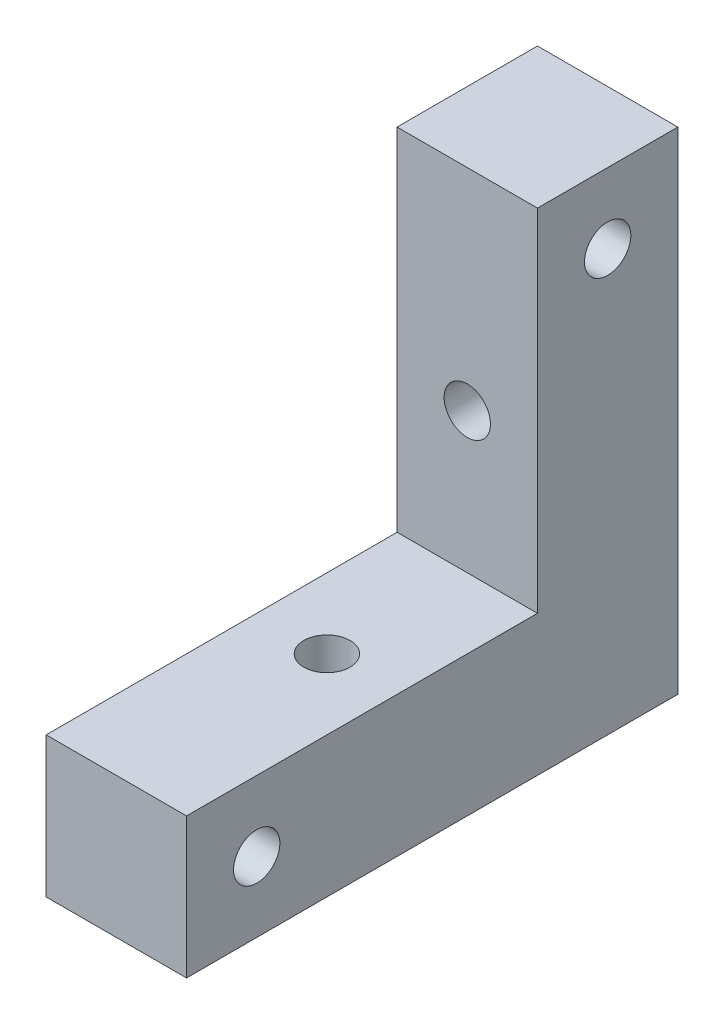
from build123d import *

# Parameters (mm, degrees)
SKETCH_1_W         = 10
SKETCH_1_H         = 10
EXTRUDE_1_DEPTH    = 35
SKETCH_2_W         = 10
SKETCH_2_H         = 10
EXTRUDE_2_DEPTH    = 25
HOLE_WIZARD_M4_4_D = 3.3
HOLE_WIZARD_M4_5_D = 3.3
HOLE_WIZARD_M4_7_D = 3.3


with BuildPart() as part:
    # Sketch 1 → Extrude 1 (new body)
    with BuildSketch(Plane.XY):
        Rectangle(SKETCH_1_W, SKETCH_1_H)
    extrude(amount=EXTRUDE_1_DEPTH)

    # Sketch 2 → Extrude 2 (add)
    with BuildSketch(Plane(origin=(0, 5, 0), x_dir=(1, 0, 0), z_dir=(0, 1, 0))):
        with Locations((0, -5)):
            Rectangle(SKETCH_2_W, SKETCH_2_H)
    extrude(amount=EXTRUDE_2_DEPTH)

    # Hole Wizard M4 _4 (through all)
    with Locations(Plane(origin=(0, 0, 0), x_dir=(-1, 0, 0), z_dir=(0, 0, -1))):
        with Locations((0, 15)):
            Hole(HOLE_WIZARD_M4_4_D / 2)

    # Hole Wizard M4 _5 (through all)
    with Locations(Plane(origin=(0, -5, 0), x_dir=(-1, 0, 0), z_dir=(0, -1, 0))):
        with Locations((0, -20)):
            Hole(HOLE_WIZARD_M4_5_D / 2)

    # Hole Wizard M4 _7 (through all)
    with Locations(Plane.ZY.offset(5)):
        with Locations((5, 25), (30, 0)):
            Hole(HOLE_WIZARD_M4_7_D / 2)


solid = part.part
